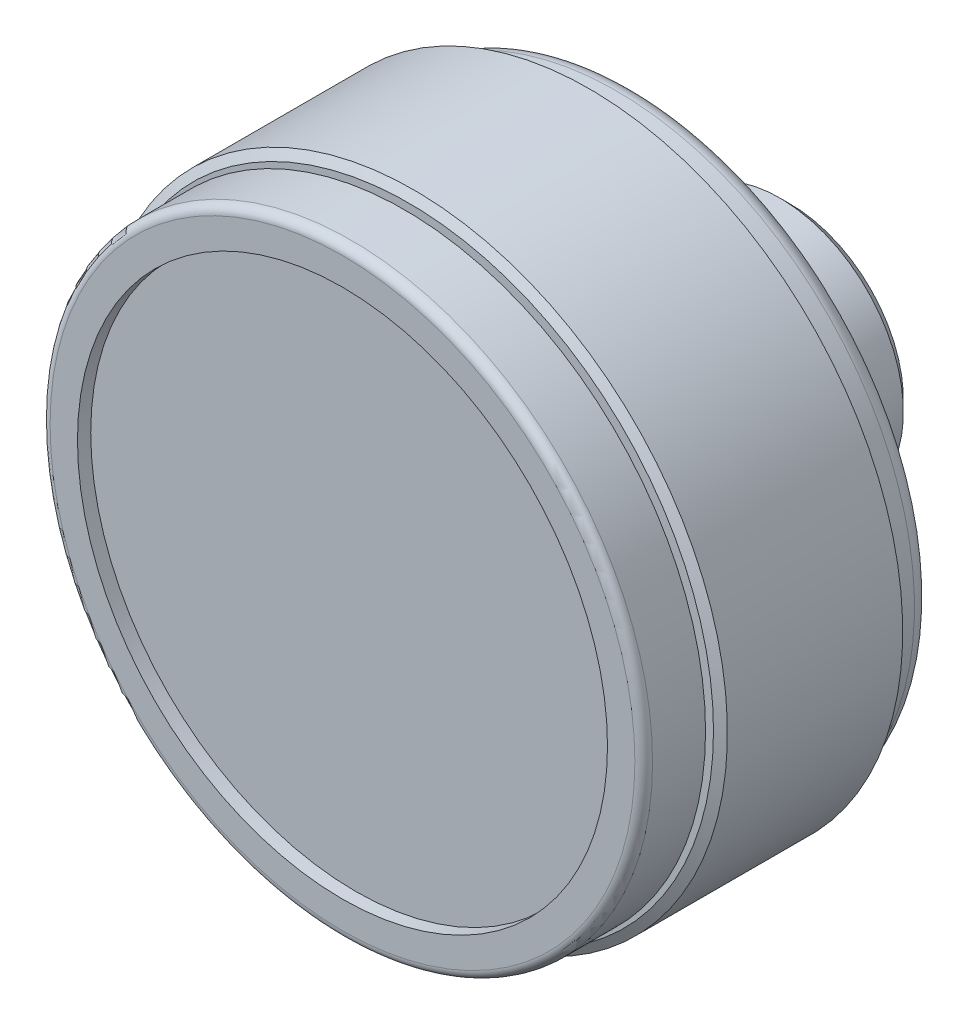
ISO-10303-21;
HEADER;
FILE_DESCRIPTION(('STEP AP214'),'2;1');
FILE_NAME('part.step','',(''),(''),'','','');
FILE_SCHEMA(('AUTOMOTIVE_DESIGN { 1 0 10303 214 1 1 1 1 }'));
ENDSEC;
DATA;
#1=APPLICATION_CONTEXT('core data for automotive mechanical design processes');
#2=APPLICATION_PROTOCOL_DEFINITION('international standard','automotive_design',2000,#1);
#3=PRODUCT_CONTEXT('',#1,'mechanical');
#4=PRODUCT('Part','Part','',(#3));
#5=PRODUCT_RELATED_PRODUCT_CATEGORY('part','',(#4));
#6=PRODUCT_DEFINITION_FORMATION('','',#4);
#7=PRODUCT_DEFINITION_CONTEXT('part definition',#1,'design');
#8=PRODUCT_DEFINITION('design','',#6,#7);
#9=PRODUCT_DEFINITION_SHAPE('','',#8);
#10=(LENGTH_UNIT() NAMED_UNIT(*) SI_UNIT(.MILLI.,.METRE.));
#11=(NAMED_UNIT(*) PLANE_ANGLE_UNIT() SI_UNIT($,.RADIAN.));
#12=(NAMED_UNIT(*) SI_UNIT($,.STERADIAN.) SOLID_ANGLE_UNIT());
#13=UNCERTAINTY_MEASURE_WITH_UNIT(LENGTH_MEASURE(1.E-05),#10,'distance_accuracy_value','');
#14=(GEOMETRIC_REPRESENTATION_CONTEXT(3) GLOBAL_UNCERTAINTY_ASSIGNED_CONTEXT((#13)) GLOBAL_UNIT_ASSIGNED_CONTEXT((#10,
#11,#12)) REPRESENTATION_CONTEXT('',''));
#15=CARTESIAN_POINT('',(0.,0.,0.));
#16=DIRECTION('',(0.,0.,1.));
#17=DIRECTION('',(1.,0.,0.));
#18=AXIS2_PLACEMENT_3D('',#15,#16,#17);
#19=CARTESIAN_POINT('',(0.,0.,50.));
#20=DIRECTION('',(0.,0.,1.));
#21=DIRECTION('',(-1.,0.,0.));
#22=AXIS2_PLACEMENT_3D('',#19,#20,#21);
#23=TOROIDAL_SURFACE('',#22,33.1,1.);
#24=CARTESIAN_POINT('',(0.,0.,50.));
#25=DIRECTION('',(0.,0.,1.));
#26=DIRECTION('',(-1.,0.,0.));
#27=AXIS2_PLACEMENT_3D('',#24,#25,#26);
#28=CIRCLE('',#27,34.1);
#29=CARTESIAN_POINT('',(-34.1,0.,50.));
#30=VERTEX_POINT('',#29);
#31=EDGE_CURVE('E8',#30,#30,#28,.T.);
#32=ORIENTED_EDGE('',*,*,#31,.T.);
#33=EDGE_LOOP('',(#32));
#34=FACE_BOUND('',#33,.T.);
#35=CARTESIAN_POINT('',(0.,0.,51.));
#36=DIRECTION('',(0.,0.,1.));
#37=DIRECTION('',(-1.,0.,0.));
#38=AXIS2_PLACEMENT_3D('',#35,#36,#37);
#39=CIRCLE('',#38,33.1);
#40=CARTESIAN_POINT('',(-33.1,0.,51.));
#41=VERTEX_POINT('',#40);
#42=EDGE_CURVE('E78',#41,#41,#39,.T.);
#43=ORIENTED_EDGE('',*,*,#42,.F.);
#44=EDGE_LOOP('',(#43));
#45=FACE_BOUND('',#44,.T.);
#46=ADVANCED_FACE('F12',(#34,#45),#23,.T.);
#47=CARTESIAN_POINT('',(0.,0.,64.9234330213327));
#48=DIRECTION('',(0.,0.,1.));
#49=DIRECTION('',(-1.,0.,0.));
#50=AXIS2_PLACEMENT_3D('',#47,#48,#49);
#51=CYLINDRICAL_SURFACE('',#50,34.1);
#52=CARTESIAN_POINT('',(0.,0.,44.));
#53=DIRECTION('',(0.,0.,1.));
#54=DIRECTION('',(-1.,0.,0.));
#55=AXIS2_PLACEMENT_3D('',#52,#53,#54);
#56=CIRCLE('',#55,34.1);
#57=CARTESIAN_POINT('',(-34.1,0.,44.));
#58=VERTEX_POINT('',#57);
#59=EDGE_CURVE('E24',#58,#58,#56,.T.);
#60=ORIENTED_EDGE('',*,*,#59,.T.);
#61=EDGE_LOOP('',(#60));
#62=FACE_BOUND('',#61,.T.);
#63=ORIENTED_EDGE('',*,*,#31,.F.);
#64=EDGE_LOOP('',(#63));
#65=FACE_BOUND('',#64,.T.);
#66=ADVANCED_FACE('F147',(#62,#65),#51,.T.);
#67=CARTESIAN_POINT('',(0.,34.1,44.));
#68=DIRECTION('',(0.,0.,-1.));
#69=DIRECTION('',(1.,0.,0.));
#70=AXIS2_PLACEMENT_3D('',#67,#68,#69);
#71=PLANE('',#70);
#72=CARTESIAN_POINT('',(0.,0.,44.));
#73=DIRECTION('',(0.,0.,1.));
#74=DIRECTION('',(-1.,0.,0.));
#75=AXIS2_PLACEMENT_3D('',#72,#73,#74);
#76=CIRCLE('',#75,32.6);
#77=CARTESIAN_POINT('',(-32.6,0.,44.));
#78=VERTEX_POINT('',#77);
#79=EDGE_CURVE('E28',#78,#78,#76,.T.);
#80=ORIENTED_EDGE('',*,*,#79,.T.);
#81=EDGE_LOOP('',(#80));
#82=FACE_BOUND('',#81,.T.);
#83=ORIENTED_EDGE('',*,*,#59,.F.);
#84=EDGE_LOOP('',(#83));
#85=FACE_BOUND('',#84,.T.);
#86=ADVANCED_FACE('F152',(#82,#85),#71,.T.);
#87=CARTESIAN_POINT('',(0.,0.,64.9234330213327));
#88=DIRECTION('',(0.,0.,1.));
#89=DIRECTION('',(-1.,0.,0.));
#90=AXIS2_PLACEMENT_3D('',#87,#88,#89);
#91=CYLINDRICAL_SURFACE('',#90,32.6);
#92=CARTESIAN_POINT('',(0.,0.,43.5));
#93=DIRECTION('',(0.,0.,1.));
#94=DIRECTION('',(-1.,0.,0.));
#95=AXIS2_PLACEMENT_3D('',#92,#93,#94);
#96=CIRCLE('',#95,32.6);
#97=CARTESIAN_POINT('',(-32.6,0.,43.5));
#98=VERTEX_POINT('',#97);
#99=EDGE_CURVE('E33',#98,#98,#96,.T.);
#100=ORIENTED_EDGE('',*,*,#99,.T.);
#101=EDGE_LOOP('',(#100));
#102=FACE_BOUND('',#101,.T.);
#103=ORIENTED_EDGE('',*,*,#79,.F.);
#104=EDGE_LOOP('',(#103));
#105=FACE_BOUND('',#104,.T.);
#106=ADVANCED_FACE('F161',(#102,#105),#91,.T.);
#107=CARTESIAN_POINT('',(0.,34.5,43.5));
#108=DIRECTION('',(0.,0.,-1.));
#109=DIRECTION('',(1.,0.,0.));
#110=AXIS2_PLACEMENT_3D('',#107,#108,#109);
#111=PLANE('',#110);
#112=ORIENTED_EDGE('',*,*,#99,.F.);
#113=EDGE_LOOP('',(#112));
#114=FACE_BOUND('',#113,.T.);
#115=CARTESIAN_POINT('',(0.,0.,43.5));
#116=DIRECTION('',(0.,0.,1.));
#117=DIRECTION('',(-1.,0.,0.));
#118=AXIS2_PLACEMENT_3D('',#115,#116,#117);
#119=CIRCLE('',#118,34.5);
#120=CARTESIAN_POINT('',(-34.5,0.,43.5));
#121=VERTEX_POINT('',#120);
#122=EDGE_CURVE('E36',#121,#121,#119,.T.);
#123=ORIENTED_EDGE('',*,*,#122,.T.);
#124=EDGE_LOOP('',(#123));
#125=FACE_BOUND('',#124,.T.);
#126=ADVANCED_FACE('F168',(#114,#125),#111,.F.);
#127=CARTESIAN_POINT('',(0.,0.,43.5));
#128=DIRECTION('',(0.,0.,-1.));
#129=DIRECTION('',(1.,0.,0.));
#130=AXIS2_PLACEMENT_3D('',#127,#128,#129);
#131=CONICAL_SURFACE('',#130,34.5,1.04719775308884);
#132=CARTESIAN_POINT('',(0.,0.,42.92265));
#133=DIRECTION('',(0.,0.,1.));
#134=DIRECTION('',(-1.,0.,0.));
#135=AXIS2_PLACEMENT_3D('',#132,#133,#134);
#136=CIRCLE('',#135,35.5);
#137=CARTESIAN_POINT('',(-35.5,0.,42.92265));
#138=VERTEX_POINT('',#137);
#139=EDGE_CURVE('E39',#138,#138,#136,.T.);
#140=ORIENTED_EDGE('',*,*,#139,.T.);
#141=EDGE_LOOP('',(#140));
#142=FACE_BOUND('',#141,.T.);
#143=ORIENTED_EDGE('',*,*,#122,.F.);
#144=EDGE_LOOP('',(#143));
#145=FACE_BOUND('',#144,.T.);
#146=ADVANCED_FACE('F172',(#142,#145),#131,.T.);
#147=CARTESIAN_POINT('',(0.,0.,64.9234330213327));
#148=DIRECTION('',(0.,0.,1.));
#149=DIRECTION('',(-1.,0.,0.));
#150=AXIS2_PLACEMENT_3D('',#147,#148,#149);
#151=CYLINDRICAL_SURFACE('',#150,35.5);
#152=CARTESIAN_POINT('',(0.,0.,23.07735));
#153=DIRECTION('',(0.,0.,1.));
#154=DIRECTION('',(-1.,0.,0.));
#155=AXIS2_PLACEMENT_3D('',#152,#153,#154);
#156=CIRCLE('',#155,35.5);
#157=CARTESIAN_POINT('',(-35.5,0.,23.07735));
#158=VERTEX_POINT('',#157);
#159=EDGE_CURVE('E42',#158,#158,#156,.T.);
#160=ORIENTED_EDGE('',*,*,#159,.T.);
#161=EDGE_LOOP('',(#160));
#162=FACE_BOUND('',#161,.T.);
#163=ORIENTED_EDGE('',*,*,#139,.F.);
#164=EDGE_LOOP('',(#163));
#165=FACE_BOUND('',#164,.T.);
#166=ADVANCED_FACE('F176',(#162,#165),#151,.T.);
#167=CARTESIAN_POINT('',(0.,0.,23.07735));
#168=DIRECTION('',(0.,0.,1.));
#169=DIRECTION('',(-1.,0.,0.));
#170=AXIS2_PLACEMENT_3D('',#167,#168,#169);
#171=CONICAL_SURFACE('',#170,35.5,1.04719775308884);
#172=CARTESIAN_POINT('',(0.,0.,22.5));
#173=DIRECTION('',(0.,0.,1.));
#174=DIRECTION('',(-1.,0.,0.));
#175=AXIS2_PLACEMENT_3D('',#172,#173,#174);
#176=CIRCLE('',#175,34.5);
#177=CARTESIAN_POINT('',(-34.5,0.,22.5));
#178=VERTEX_POINT('',#177);
#179=EDGE_CURVE('E45',#178,#178,#176,.T.);
#180=ORIENTED_EDGE('',*,*,#179,.T.);
#181=EDGE_LOOP('',(#180));
#182=FACE_BOUND('',#181,.T.);
#183=ORIENTED_EDGE('',*,*,#159,.F.);
#184=EDGE_LOOP('',(#183));
#185=FACE_BOUND('',#184,.T.);
#186=ADVANCED_FACE('F180',(#182,#185),#171,.T.);
#187=CARTESIAN_POINT('',(0.,33.75,22.5));
#188=DIRECTION('',(0.,0.,1.));
#189=DIRECTION('',(-1.,0.,0.));
#190=AXIS2_PLACEMENT_3D('',#187,#188,#189);
#191=PLANE('',#190);
#192=ORIENTED_EDGE('',*,*,#179,.F.);
#193=EDGE_LOOP('',(#192));
#194=FACE_BOUND('',#193,.T.);
#195=CARTESIAN_POINT('',(0.,0.,22.5));
#196=DIRECTION('',(0.,0.,1.));
#197=DIRECTION('',(-1.,0.,0.));
#198=AXIS2_PLACEMENT_3D('',#195,#196,#197);
#199=CIRCLE('',#198,33.75);
#200=CARTESIAN_POINT('',(-33.75,0.,22.5));
#201=VERTEX_POINT('',#200);
#202=EDGE_CURVE('E48',#201,#201,#199,.T.);
#203=ORIENTED_EDGE('',*,*,#202,.T.);
#204=EDGE_LOOP('',(#203));
#205=FACE_BOUND('',#204,.T.);
#206=ADVANCED_FACE('F184',(#194,#205),#191,.F.);
#207=CARTESIAN_POINT('',(0.,0.,64.9234330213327));
#208=DIRECTION('',(0.,0.,1.));
#209=DIRECTION('',(-1.,0.,0.));
#210=AXIS2_PLACEMENT_3D('',#207,#208,#209);
#211=CYLINDRICAL_SURFACE('',#210,33.75);
#212=CARTESIAN_POINT('',(0.,0.,20.));
#213=DIRECTION('',(0.,0.,1.));
#214=DIRECTION('',(-1.,0.,0.));
#215=AXIS2_PLACEMENT_3D('',#212,#213,#214);
#216=CIRCLE('',#215,33.75);
#217=CARTESIAN_POINT('',(-33.75,0.,20.));
#218=VERTEX_POINT('',#217);
#219=EDGE_CURVE('E51',#218,#218,#216,.T.);
#220=ORIENTED_EDGE('',*,*,#219,.T.);
#221=EDGE_LOOP('',(#220));
#222=FACE_BOUND('',#221,.T.);
#223=ORIENTED_EDGE('',*,*,#202,.F.);
#224=EDGE_LOOP('',(#223));
#225=FACE_BOUND('',#224,.T.);
#226=ADVANCED_FACE('F188',(#222,#225),#211,.T.);
#227=CARTESIAN_POINT('',(0.,0.,20.));
#228=DIRECTION('',(0.,0.,1.));
#229=DIRECTION('',(-1.,0.,0.));
#230=AXIS2_PLACEMENT_3D('',#227,#228,#229);
#231=TOROIDAL_SURFACE('',#230,31.75,2.);
#232=CARTESIAN_POINT('',(0.,0.,18.));
#233=DIRECTION('',(0.,0.,1.));
#234=DIRECTION('',(-1.,0.,0.));
#235=AXIS2_PLACEMENT_3D('',#232,#233,#234);
#236=CIRCLE('',#235,31.75);
#237=CARTESIAN_POINT('',(-31.75,0.,18.));
#238=VERTEX_POINT('',#237);
#239=EDGE_CURVE('E54',#238,#238,#236,.T.);
#240=ORIENTED_EDGE('',*,*,#239,.T.);
#241=EDGE_LOOP('',(#240));
#242=FACE_BOUND('',#241,.T.);
#243=ORIENTED_EDGE('',*,*,#219,.F.);
#244=EDGE_LOOP('',(#243));
#245=FACE_BOUND('',#244,.T.);
#246=ADVANCED_FACE('F192',(#242,#245),#231,.T.);
#247=CARTESIAN_POINT('',(0.,16.,18.));
#248=DIRECTION('',(0.,0.,1.));
#249=DIRECTION('',(-1.,0.,0.));
#250=AXIS2_PLACEMENT_3D('',#247,#248,#249);
#251=PLANE('',#250);
#252=ORIENTED_EDGE('',*,*,#239,.F.);
#253=EDGE_LOOP('',(#252));
#254=FACE_BOUND('',#253,.T.);
#255=CARTESIAN_POINT('',(0.,0.,18.));
#256=DIRECTION('',(0.,0.,1.));
#257=DIRECTION('',(-1.,0.,0.));
#258=AXIS2_PLACEMENT_3D('',#255,#256,#257);
#259=CIRCLE('',#258,16.);
#260=CARTESIAN_POINT('',(-16.,0.,18.));
#261=VERTEX_POINT('',#260);
#262=EDGE_CURVE('E57',#261,#261,#259,.T.);
#263=ORIENTED_EDGE('',*,*,#262,.T.);
#264=EDGE_LOOP('',(#263));
#265=FACE_BOUND('',#264,.T.);
#266=ADVANCED_FACE('F196',(#254,#265),#251,.F.);
#267=CARTESIAN_POINT('',(0.,0.,16.0010004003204));
#268=DIRECTION('',(0.,0.,1.));
#269=DIRECTION('',(-1.,0.,0.));
#270=AXIS2_PLACEMENT_3D('',#267,#268,#269);
#271=TOROIDAL_SURFACE('',#270,15.9367496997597,2.);
#272=ORIENTED_EDGE('',*,*,#262,.F.);
#273=EDGE_LOOP('',(#272));
#274=FACE_BOUND('',#273,.T.);
#275=CARTESIAN_POINT('',(0.,0.,16.5));
#276=DIRECTION('',(0.,0.,1.));
#277=DIRECTION('',(-1.,0.,0.));
#278=AXIS2_PLACEMENT_3D('',#275,#276,#277);
#279=CIRCLE('',#278,14.);
#280=CARTESIAN_POINT('',(-14.,0.,16.5));
#281=VERTEX_POINT('',#280);
#282=EDGE_CURVE('E60',#281,#281,#279,.T.);
#283=ORIENTED_EDGE('',*,*,#282,.T.);
#284=EDGE_LOOP('',(#283));
#285=FACE_BOUND('',#284,.T.);
#286=ADVANCED_FACE('F142',(#274,#285),#271,.F.);
#287=CARTESIAN_POINT('',(0.,0.,64.9234330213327));
#288=DIRECTION('',(0.,0.,1.));
#289=DIRECTION('',(-1.,0.,0.));
#290=AXIS2_PLACEMENT_3D('',#287,#288,#289);
#291=CYLINDRICAL_SURFACE('',#290,14.);
#292=CARTESIAN_POINT('',(13.9961059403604,-0.330179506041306,3.5));
#293=CARTESIAN_POINT('',(13.999380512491,-0.191270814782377,3.50000531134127));
#294=CARTESIAN_POINT('',(14.0005722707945,-0.0522430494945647,3.51161611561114));
#295=CARTESIAN_POINT('',(13.9989131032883,0.222004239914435,3.55777535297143));
#296=CARTESIAN_POINT('',(13.9960588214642,0.357220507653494,3.5923428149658));
#297=CARTESIAN_POINT('',(13.9868889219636,0.619834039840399,3.68337132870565));
#298=CARTESIAN_POINT('',(13.9805758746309,0.747237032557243,3.73981611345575));
#299=CARTESIAN_POINT('',(13.9654305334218,0.990786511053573,3.8729568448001));
#300=CARTESIAN_POINT('',(13.956598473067,1.10693403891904,3.94965091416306));
#301=CARTESIAN_POINT('',(13.9375245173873,1.32574014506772,4.12184467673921));
#302=CARTESIAN_POINT('',(13.9272717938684,1.42828198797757,4.21749149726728));
#303=CARTESIAN_POINT('',(13.9067453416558,1.61597327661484,4.42455777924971));
#304=CARTESIAN_POINT('',(13.8964716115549,1.70112151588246,4.53597833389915));
#305=CARTESIAN_POINT('',(13.877135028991,1.85229584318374,4.77253694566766));
#306=CARTESIAN_POINT('',(13.8680829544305,1.91815705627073,4.89778135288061));
#307=CARTESIAN_POINT('',(13.8524653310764,2.02787928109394,5.15770794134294));
#308=CARTESIAN_POINT('',(13.8458996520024,2.07174144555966,5.29238962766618));
#309=CARTESIAN_POINT('',(13.8361443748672,2.13592279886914,5.56640464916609));
#310=CARTESIAN_POINT('',(13.8329321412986,2.15639992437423,5.70570016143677));
#311=CARTESIAN_POINT('',(13.830222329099,2.17371379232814,5.98578412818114));
#312=CARTESIAN_POINT('',(13.83072451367,2.17055204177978,6.12657248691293));
#313=CARTESIAN_POINT('',(13.8353552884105,2.14083156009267,6.40425428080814));
#314=CARTESIAN_POINT('',(13.8394498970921,2.11449206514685,6.54117183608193));
#315=CARTESIAN_POINT('',(13.8506978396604,2.03950821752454,6.80862243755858));
#316=CARTESIAN_POINT('',(13.8578512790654,1.99086309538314,6.93915526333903));
#317=CARTESIAN_POINT('',(13.8743502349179,1.87242554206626,7.19077720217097));
#318=CARTESIAN_POINT('',(13.8837050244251,1.80254327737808,7.31182339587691));
#319=CARTESIAN_POINT('',(13.9034077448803,1.64366680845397,7.5405598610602));
#320=CARTESIAN_POINT('',(13.9137557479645,1.55467121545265,7.64824916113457));
#321=CARTESIAN_POINT('',(13.9342381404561,1.35895830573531,7.84840754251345));
#322=CARTESIAN_POINT('',(13.9443691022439,1.25206311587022,7.9407031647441));
#323=CARTESIAN_POINT('',(13.9629546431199,1.0241797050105,8.10606958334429));
#324=CARTESIAN_POINT('',(13.9714092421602,0.903191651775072,8.17914060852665));
#325=CARTESIAN_POINT('',(13.9854398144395,0.650703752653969,8.30383579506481));
#326=CARTESIAN_POINT('',(13.9910203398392,0.519220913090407,8.35549384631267));
#327=CARTESIAN_POINT('',(13.9984295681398,0.249345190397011,8.43597492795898));
#328=CARTESIAN_POINT('',(14.0002586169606,0.110952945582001,8.46480006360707));
#329=CARTESIAN_POINT('',(13.9996854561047,-0.166943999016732,8.49853978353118));
#330=CARTESIAN_POINT('',(13.9973359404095,-0.306413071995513,8.50374923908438));
#331=CARTESIAN_POINT('',(13.9884981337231,-0.584143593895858,8.49094885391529));
#332=CARTESIAN_POINT('',(13.9820099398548,-0.722405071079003,8.47293955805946));
#333=CARTESIAN_POINT('',(13.9653731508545,-0.993339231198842,8.41440758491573));
#334=CARTESIAN_POINT('',(13.9552371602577,-1.12602942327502,8.37396217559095));
#335=CARTESIAN_POINT('',(13.9321476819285,-1.38270863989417,8.27184183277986));
#336=CARTESIAN_POINT('',(13.9191939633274,-1.5066969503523,8.210165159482));
#337=CARTESIAN_POINT('',(13.891442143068,-1.74422941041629,8.06639468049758));
#338=CARTESIAN_POINT('',(13.8766221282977,-1.85761569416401,7.98404431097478));
#339=CARTESIAN_POINT('',(13.8466757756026,-2.06905634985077,7.80161272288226));
#340=CARTESIAN_POINT('',(13.8315494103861,-2.16710934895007,7.70152991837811));
#341=CARTESIAN_POINT('',(13.8022944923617,-2.34627882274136,7.48503075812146));
#342=CARTESIAN_POINT('',(13.7881798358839,-2.42718156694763,7.36843543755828));
#343=CARTESIAN_POINT('',(13.7626086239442,-2.56822184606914,7.12302799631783));
#344=CARTESIAN_POINT('',(13.7511519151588,-2.62836057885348,6.99421658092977));
#345=CARTESIAN_POINT('',(13.7322027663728,-2.72563002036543,6.72910112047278));
#346=CARTESIAN_POINT('',(13.7246786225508,-2.76294515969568,6.59286709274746));
#347=CARTESIAN_POINT('',(13.7142749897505,-2.8141351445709,6.31589675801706));
#348=CARTESIAN_POINT('',(13.7113949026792,-2.82801300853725,6.17516103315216));
#349=CARTESIAN_POINT('',(13.7106044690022,-2.83184128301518,5.89592641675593));
#350=CARTESIAN_POINT('',(13.7126045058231,-2.82222316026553,5.75743350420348));
#351=CARTESIAN_POINT('',(13.7211713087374,-2.78027133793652,5.48408324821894));
#352=CARTESIAN_POINT('',(13.7277380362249,-2.74793783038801,5.34922587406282));
#353=CARTESIAN_POINT('',(13.7447279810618,-2.66164727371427,5.08717200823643));
#354=CARTESIAN_POINT('',(13.7551438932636,-2.60773116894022,4.95996153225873));
#355=CARTESIAN_POINT('',(13.778769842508,-2.47986103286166,4.71633317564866));
#356=CARTESIAN_POINT('',(13.7919800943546,-2.40590546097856,4.59991612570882));
#357=CARTESIAN_POINT('',(13.8201316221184,-2.23858460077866,4.37904014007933));
#358=CARTESIAN_POINT('',(13.8350985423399,-2.14491026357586,4.27481856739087));
#359=CARTESIAN_POINT('',(13.8651078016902,-1.9414779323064,4.083434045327));
#360=CARTESIAN_POINT('',(13.8801501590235,-1.83171585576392,3.99627543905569));
#361=CARTESIAN_POINT('',(13.9090464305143,-1.59765064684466,3.84048057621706));
#362=CARTESIAN_POINT('',(13.922883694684,-1.47318712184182,3.77208209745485));
#363=CARTESIAN_POINT('',(13.9478401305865,-1.21433098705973,3.6572914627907));
#364=CARTESIAN_POINT('',(13.9589618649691,-1.07994789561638,3.61087851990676));
#365=CARTESIAN_POINT('',(13.9749767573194,-0.842668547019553,3.55092063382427));
#366=CARTESIAN_POINT('',(13.9807414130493,-0.741188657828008,3.53186240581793));
#367=CARTESIAN_POINT('',(13.9900893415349,-0.536554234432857,3.50640028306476));
#368=CARTESIAN_POINT('',(13.9936726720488,-0.433399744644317,3.49999605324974));
#369=CARTESIAN_POINT('',(13.9961059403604,-0.330179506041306,3.5));
#370=B_SPLINE_CURVE_WITH_KNOTS('',3,(#292,#293,#294,#295,#296,#297,#298,#299,#300,#301,#302,
#303,#304,#305,#306,#307,#308,#309,#310,#311,#312,#313,#314,#315,#316,#317,#318,#319,#320,#321,
#322,#323,#324,#325,#326,#327,#328,#329,#330,#331,#332,#333,#334,#335,#336,#337,#338,#339,#340,
#341,#342,#343,#344,#345,#346,#347,#348,#349,#350,#351,#352,#353,#354,#355,#356,#357,#358,#359,
#360,#361,#362,#363,#364,#365,#366,#367,#368,#369),.UNSPECIFIED.,.T.,.F.,(4,2,2,2,2,2,2,2,2,2,2,
2,2,2,2,2,2,2,2,2,2,2,2,2,2,2,2,2,2,2,2,2,2,2,2,2,2,2,4),(0.,0.416466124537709,
0.833277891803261,1.24978032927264,1.66624416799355,2.08607741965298,2.50593978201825,
2.9292930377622,3.35262410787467,3.773078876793,4.19350684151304,4.61000025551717,
5.02650803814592,5.44480277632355,5.86312791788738,6.28588789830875,6.70864284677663,
7.13072613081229,7.5527704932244,7.96953032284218,8.3862803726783,8.80160400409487,
9.21696167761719,9.63775355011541,10.0585830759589,10.4843833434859,10.9101590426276,
11.3324470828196,11.7546807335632,12.1692192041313,12.583754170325,12.9975064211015,
13.4112904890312,13.8321200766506,14.2530566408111,14.6791048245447,15.1047493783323,
15.4142251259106,15.7236926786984),.UNSPECIFIED.);
#371=CARTESIAN_POINT('',(13.9961059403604,-0.330179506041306,3.5));
#372=VERTEX_POINT('',#371);
#373=EDGE_CURVE('E87',#372,#372,#370,.T.);
#374=ORIENTED_EDGE('',*,*,#373,.F.);
#375=EDGE_LOOP('',(#374));
#376=FACE_BOUND('',#375,.T.);
#377=CARTESIAN_POINT('',(0.,0.,1.5));
#378=DIRECTION('',(0.,0.,1.));
#379=DIRECTION('',(-1.,0.,0.));
#380=AXIS2_PLACEMENT_3D('',#377,#378,#379);
#381=CIRCLE('',#380,14.);
#382=CARTESIAN_POINT('',(-14.,0.,1.5));
#383=VERTEX_POINT('',#382);
#384=EDGE_CURVE('E63',#383,#383,#381,.T.);
#385=ORIENTED_EDGE('',*,*,#384,.T.);
#386=EDGE_LOOP('',(#385));
#387=FACE_BOUND('',#386,.T.);
#388=ORIENTED_EDGE('',*,*,#282,.F.);
#389=EDGE_LOOP('',(#388));
#390=FACE_BOUND('',#389,.T.);
#391=ADVANCED_FACE('F95',(#376,#387,#390),#291,.T.);
#392=CARTESIAN_POINT('',(0.,0.,0.299999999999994));
#393=DIRECTION('',(0.,0.,1.));
#394=DIRECTION('',(-1.,0.,0.));
#395=AXIS2_PLACEMENT_3D('',#392,#393,#394);
#396=CONICAL_SURFACE('',#395,12.8,0.785398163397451);
#397=ORIENTED_EDGE('',*,*,#384,.F.);
#398=EDGE_LOOP('',(#397));
#399=FACE_BOUND('',#398,.T.);
#400=CARTESIAN_POINT('',(0.,0.,0.299999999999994));
#401=DIRECTION('',(0.,0.,1.));
#402=DIRECTION('',(-1.,0.,0.));
#403=AXIS2_PLACEMENT_3D('',#400,#401,#402);
#404=CIRCLE('',#403,12.8);
#405=CARTESIAN_POINT('',(-12.8,0.,0.299999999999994));
#406=VERTEX_POINT('',#405);
#407=EDGE_CURVE('E66',#406,#406,#404,.T.);
#408=ORIENTED_EDGE('',*,*,#407,.T.);
#409=EDGE_LOOP('',(#408));
#410=FACE_BOUND('',#409,.T.);
#411=ADVANCED_FACE('F133',(#399,#410),#396,.T.);
#412=CARTESIAN_POINT('',(0.,11.4166817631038,0.299999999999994));
#413=DIRECTION('',(0.,0.,1.));
#414=DIRECTION('',(-1.,0.,0.));
#415=AXIS2_PLACEMENT_3D('',#412,#413,#414);
#416=PLANE('',#415);
#417=ORIENTED_EDGE('',*,*,#407,.F.);
#418=EDGE_LOOP('',(#417));
#419=FACE_BOUND('',#418,.T.);
#420=CARTESIAN_POINT('',(0.,0.,0.299999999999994));
#421=DIRECTION('',(0.,0.,1.));
#422=DIRECTION('',(-1.,0.,0.));
#423=AXIS2_PLACEMENT_3D('',#420,#421,#422);
#424=CIRCLE('',#423,11.4166817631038);
#425=CARTESIAN_POINT('',(-11.4166817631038,0.,0.299999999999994));
#426=VERTEX_POINT('',#425);
#427=EDGE_CURVE('E69',#426,#426,#424,.T.);
#428=ORIENTED_EDGE('',*,*,#427,.T.);
#429=EDGE_LOOP('',(#428));
#430=FACE_BOUND('',#429,.T.);
#431=ADVANCED_FACE('F130',(#419,#430),#416,.F.);
#432=CARTESIAN_POINT('',(0.,0.,0.));
#433=DIRECTION('',(0.,0.,1.));
#434=DIRECTION('',(-1.,0.,0.));
#435=AXIS2_PLACEMENT_3D('',#432,#433,#434);
#436=CONICAL_SURFACE('',#435,11.,0.946790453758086);
#437=ORIENTED_EDGE('',*,*,#427,.F.);
#438=EDGE_LOOP('',(#437));
#439=FACE_BOUND('',#438,.T.);
#440=CARTESIAN_POINT('',(0.,0.,0.));
#441=DIRECTION('',(0.,0.,1.));
#442=DIRECTION('',(-1.,0.,0.));
#443=AXIS2_PLACEMENT_3D('',#440,#441,#442);
#444=CIRCLE('',#443,11.);
#445=CARTESIAN_POINT('',(-11.,0.,0.));
#446=VERTEX_POINT('',#445);
#447=EDGE_CURVE('E72',#446,#446,#444,.T.);
#448=ORIENTED_EDGE('',*,*,#447,.T.);
#449=EDGE_LOOP('',(#448));
#450=FACE_BOUND('',#449,.T.);
#451=ADVANCED_FACE('F126',(#439,#450),#436,.T.);
#452=CARTESIAN_POINT('',(0.,5.,0.));
#453=DIRECTION('',(0.,0.,1.));
#454=DIRECTION('',(-1.,0.,0.));
#455=AXIS2_PLACEMENT_3D('',#452,#453,#454);
#456=PLANE('',#455);
#457=ORIENTED_EDGE('',*,*,#447,.F.);
#458=EDGE_LOOP('',(#457));
#459=FACE_BOUND('',#458,.T.);
#460=CARTESIAN_POINT('',(0.,0.,0.));
#461=DIRECTION('',(0.,0.,1.));
#462=DIRECTION('',(-1.,0.,0.));
#463=AXIS2_PLACEMENT_3D('',#460,#461,#462);
#464=CIRCLE('',#463,5.);
#465=CARTESIAN_POINT('',(-5.,0.,0.));
#466=VERTEX_POINT('',#465);
#467=EDGE_CURVE('E75',#466,#466,#464,.T.);
#468=ORIENTED_EDGE('',*,*,#467,.T.);
#469=EDGE_LOOP('',(#468));
#470=FACE_BOUND('',#469,.T.);
#471=ADVANCED_FACE('F122',(#459,#470),#456,.F.);
#472=CARTESIAN_POINT('',(0.,0.,64.9234330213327));
#473=DIRECTION('',(0.,0.,1.));
#474=DIRECTION('',(-1.,0.,0.));
#475=AXIS2_PLACEMENT_3D('',#472,#473,#474);
#476=CYLINDRICAL_SURFACE('',#475,5.);
#477=CARTESIAN_POINT('',(4.98908623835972,-0.330179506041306,3.5));
#478=CARTESIAN_POINT('',(4.99763794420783,-0.200839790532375,3.5000095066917));
#479=CARTESIAN_POINT('',(5.00113322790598,-0.0710217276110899,3.51009434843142));
#480=CARTESIAN_POINT('',(4.99821184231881,0.185469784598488,3.55030302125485));
#481=CARTESIAN_POINT('',(4.99177987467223,0.312138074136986,3.58045774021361));
#482=CARTESIAN_POINT('',(4.97027248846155,0.558214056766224,3.65961331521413));
#483=CARTESIAN_POINT('',(4.95522299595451,0.6776423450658,3.70855749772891));
#484=CARTESIAN_POINT('',(4.91846922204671,0.906719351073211,3.8236433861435));
#485=CARTESIAN_POINT('',(4.89676494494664,1.0163680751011,3.8897850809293));
#486=CARTESIAN_POINT('',(4.84800509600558,1.22851088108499,4.04086273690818));
#487=CARTESIAN_POINT('',(4.82074836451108,1.33043905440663,4.12652678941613));
#488=CARTESIAN_POINT('',(4.76461110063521,1.5192774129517,4.31266288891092));
#489=CARTESIAN_POINT('',(4.735729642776,1.60617892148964,4.41314342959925));
#490=CARTESIAN_POINT('',(4.67737501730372,1.76924742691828,4.63515543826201));
#491=CARTESIAN_POINT('',(4.64802770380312,1.84407151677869,4.75771233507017));
#492=CARTESIAN_POINT('',(4.59521215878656,1.97201506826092,5.01485981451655));
#493=CARTESIAN_POINT('',(4.57174196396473,2.0251417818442,5.14944635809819));
#494=CARTESIAN_POINT('',(4.53489334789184,2.10634628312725,5.4228907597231));
#495=CARTESIAN_POINT('',(4.52123349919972,2.13512721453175,5.56149963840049));
#496=CARTESIAN_POINT('',(4.5051706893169,2.16882763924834,5.84218845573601));
#497=CARTESIAN_POINT('',(4.50275925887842,2.17376508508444,5.98426570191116));
#498=CARTESIAN_POINT('',(4.50927156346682,2.16020618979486,6.25410943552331));
#499=CARTESIAN_POINT('',(4.51719310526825,2.14378212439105,6.38201144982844));
#500=CARTESIAN_POINT('',(4.54151966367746,2.09174888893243,6.63300621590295));
#501=CARTESIAN_POINT('',(4.55792664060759,2.05613528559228,6.75609784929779));
#502=CARTESIAN_POINT('',(4.59732975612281,1.96646091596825,6.99602469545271));
#503=CARTESIAN_POINT('',(4.62040741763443,1.91217023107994,7.11275985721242));
#504=CARTESIAN_POINT('',(4.67032011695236,1.78680014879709,7.3359637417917));
#505=CARTESIAN_POINT('',(4.69715673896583,1.71571366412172,7.44242810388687));
#506=CARTESIAN_POINT('',(4.75426424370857,1.55089005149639,7.65258492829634));
#507=CARTESIAN_POINT('',(4.78462129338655,1.45565464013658,7.75508285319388));
#508=CARTESIAN_POINT('',(4.84268598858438,1.24896261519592,7.9431511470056));
#509=CARTESIAN_POINT('',(4.87039297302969,1.13750197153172,8.02871729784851));
#510=CARTESIAN_POINT('',(4.92017858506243,0.898355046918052,8.18203403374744));
#511=CARTESIAN_POINT('',(4.94213010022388,0.770382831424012,8.24938316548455));
#512=CARTESIAN_POINT('',(4.97638065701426,0.503644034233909,8.36127311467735));
#513=CARTESIAN_POINT('',(4.98868710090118,0.364885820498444,8.40583141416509));
#514=CARTESIAN_POINT('',(5.00084242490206,0.0927498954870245,8.46758890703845));
#515=CARTESIAN_POINT('',(5.00162193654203,-0.0401494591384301,8.48671628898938));
#516=CARTESIAN_POINT('',(4.99235404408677,-0.306901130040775,8.50345784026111));
#517=CARTESIAN_POINT('',(4.98230980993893,-0.440753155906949,8.5010783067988));
#518=CARTESIAN_POINT('',(4.95266442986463,-0.697815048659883,8.47600594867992));
#519=CARTESIAN_POINT('',(4.93362292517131,-0.821203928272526,8.45444455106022));
#520=CARTESIAN_POINT('',(4.88746035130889,-1.06196448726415,8.3937238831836));
#521=CARTESIAN_POINT('',(4.86033781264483,-1.17933506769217,8.35456141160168));
#522=CARTESIAN_POINT('',(4.79822312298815,-1.41146356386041,8.25775289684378));
#523=CARTESIAN_POINT('',(4.76289818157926,-1.52577724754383,8.1992604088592));
#524=CARTESIAN_POINT('',(4.68773095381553,-1.74310772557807,8.06636877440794));
#525=CARTESIAN_POINT('',(4.64788648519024,-1.84611901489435,7.99196192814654));
#526=CARTESIAN_POINT('',(4.56181265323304,-2.05023558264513,7.81966968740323));
#527=CARTESIAN_POINT('',(4.51536961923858,-2.14981931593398,7.72008376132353));
#528=CARTESIAN_POINT('',(4.42437550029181,-2.33135879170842,7.50502731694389));
#529=CARTESIAN_POINT('',(4.37982623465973,-2.41329787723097,7.38954195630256));
#530=CARTESIAN_POINT('',(4.29548473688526,-2.56053299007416,7.13909384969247));
#531=CARTESIAN_POINT('',(4.25599040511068,-2.62493164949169,7.00349517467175));
#532=CARTESIAN_POINT('',(4.19009206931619,-2.7289165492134,6.72021004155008));
#533=CARTESIAN_POINT('',(4.16366104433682,-2.76855405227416,6.57254927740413));
#534=CARTESIAN_POINT('',(4.13117469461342,-2.81675847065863,6.29073296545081));
#535=CARTESIAN_POINT('',(4.12285528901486,-2.82878993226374,6.15743553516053));
#536=CARTESIAN_POINT('',(4.12110877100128,-2.83133873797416,5.89055813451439));
#537=CARTESIAN_POINT('',(4.12767456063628,-2.82186633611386,5.75697832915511));
#538=CARTESIAN_POINT('',(4.15287355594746,-2.78460711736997,5.51075897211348));
#539=CARTESIAN_POINT('',(4.16991505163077,-2.75922847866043,5.39757178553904));
#540=CARTESIAN_POINT('',(4.21252912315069,-2.693718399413,5.17726101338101));
#541=CARTESIAN_POINT('',(4.23810463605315,-2.65358187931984,5.07013953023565));
#542=CARTESIAN_POINT('',(4.29784993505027,-2.55578470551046,4.85461803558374));
#543=CARTESIAN_POINT('',(4.33257818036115,-2.49689218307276,4.74693600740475));
#544=CARTESIAN_POINT('',(4.40605463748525,-2.36482525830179,4.54223619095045));
#545=CARTESIAN_POINT('',(4.44480514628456,-2.29164267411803,4.4452245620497));
#546=CARTESIAN_POINT('',(4.52986035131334,-2.11920571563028,4.24808247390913));
#547=CARTESIAN_POINT('',(4.57636306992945,-2.01764444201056,4.15004212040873));
#548=CARTESIAN_POINT('',(4.66675968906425,-1.79872578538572,3.97186643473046));
#549=CARTESIAN_POINT('',(4.71065139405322,-1.68135537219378,3.89174601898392));
#550=CARTESIAN_POINT('',(4.79364506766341,-1.42804439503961,3.74909994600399));
#551=CARTESIAN_POINT('',(4.83249750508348,-1.29156277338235,3.6873706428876));
#552=CARTESIAN_POINT('',(4.88277561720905,-1.07881803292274,3.6135407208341));
#553=CARTESIAN_POINT('',(4.89819314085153,-1.00662222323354,3.5920670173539));
#554=CARTESIAN_POINT('',(4.92603730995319,-0.86005827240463,3.55563574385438));
#555=CARTESIAN_POINT('',(4.93846582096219,-0.785691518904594,3.54067410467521));
#556=CARTESIAN_POINT('',(4.95824421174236,-0.647936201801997,3.51946613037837));
#557=CARTESIAN_POINT('',(4.96609482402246,-0.58477681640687,3.51218470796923));
#558=CARTESIAN_POINT('',(4.97940377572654,-0.457843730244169,3.50244909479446));
#559=CARTESIAN_POINT('',(4.98486191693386,-0.394069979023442,3.49999530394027));
#560=CARTESIAN_POINT('',(4.98908623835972,-0.330179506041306,3.5));
#561=B_SPLINE_CURVE_WITH_KNOTS('',3,(#477,#478,#479,#480,#481,#482,#483,#484,#485,#486,#487,
#488,#489,#490,#491,#492,#493,#494,#495,#496,#497,#498,#499,#500,#501,#502,#503,#504,#505,#506,
#507,#508,#509,#510,#511,#512,#513,#514,#515,#516,#517,#518,#519,#520,#521,#522,#523,#524,#525,
#526,#527,#528,#529,#530,#531,#532,#533,#534,#535,#536,#537,#538,#539,#540,#541,#542,#543,#544,
#545,#546,#547,#548,#549,#550,#551,#552,#553,#554,#555,#556,#557,#558,#559,#560),.UNSPECIFIED.,
.T.,.F.,(4,2,2,2,2,2,2,2,2,2,2,2,2,2,2,2,2,2,2,2,2,2,2,2,2,2,2,2,2,2,2,2,2,2,2,2,2,2,2,2,2,4),
(0.,0.388623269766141,0.777846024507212,1.16590389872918,1.5539615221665,1.95997715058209,
2.36622644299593,2.80377563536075,3.24117846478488,3.66546941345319,4.0894408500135,
4.47519414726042,4.86103660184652,5.25180969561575,5.6427479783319,6.0703186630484,
6.49799573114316,6.93444569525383,7.37056037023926,7.77125339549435,8.17182910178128,
8.5502369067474,8.92871356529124,9.32664012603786,9.72475965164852,10.1677212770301,
10.6110992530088,11.0741054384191,11.5361498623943,11.9359903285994,12.3356401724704,
12.6858970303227,13.0362745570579,13.4175041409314,13.7989526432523,14.2428571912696,
14.6871298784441,15.1485107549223,15.3788619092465,15.6090689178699,15.8010228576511,
15.992992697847),.UNSPECIFIED.);
#562=CARTESIAN_POINT('',(4.98908623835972,-0.330179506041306,3.5));
#563=VERTEX_POINT('',#562);
#564=EDGE_CURVE('E15',#563,#563,#561,.T.);
#565=ORIENTED_EDGE('',*,*,#564,.T.);
#566=EDGE_LOOP('',(#565));
#567=FACE_BOUND('',#566,.T.);
#568=ORIENTED_EDGE('',*,*,#467,.F.);
#569=EDGE_LOOP('',(#568));
#570=FACE_BOUND('',#569,.T.);
#571=CARTESIAN_POINT('',(0.,0.,22.));
#572=DIRECTION('',(0.,0.,-1.));
#573=DIRECTION('',(-1.,0.,0.));
#574=AXIS2_PLACEMENT_3D('',#571,#572,#573);
#575=CIRCLE('',#574,5.);
#576=CARTESIAN_POINT('',(-5.,0.,22.));
#577=VERTEX_POINT('',#576);
#578=EDGE_CURVE('E94',#577,#577,#575,.T.);
#579=ORIENTED_EDGE('',*,*,#578,.F.);
#580=EDGE_LOOP('',(#579));
#581=FACE_BOUND('',#580,.T.);
#582=ADVANCED_FACE('F117',(#567,#570,#581),#476,.F.);
#583=CARTESIAN_POINT('',(0.,33.1,51.));
#584=DIRECTION('',(0.,0.,-1.));
#585=DIRECTION('',(1.,0.,0.));
#586=AXIS2_PLACEMENT_3D('',#583,#584,#585);
#587=PLANE('',#586);
#588=CARTESIAN_POINT('',(0.,0.,51.));
#589=DIRECTION('',(0.,0.,1.));
#590=DIRECTION('',(-1.,0.,0.));
#591=AXIS2_PLACEMENT_3D('',#588,#589,#590);
#592=CIRCLE('',#591,30.);
#593=CARTESIAN_POINT('',(-30.,0.,51.));
#594=VERTEX_POINT('',#593);
#595=EDGE_CURVE('E84',#594,#594,#592,.T.);
#596=ORIENTED_EDGE('',*,*,#595,.F.);
#597=EDGE_LOOP('',(#596));
#598=FACE_BOUND('',#597,.T.);
#599=ORIENTED_EDGE('',*,*,#42,.T.);
#600=EDGE_LOOP('',(#599));
#601=FACE_BOUND('',#600,.T.);
#602=ADVANCED_FACE('F112',(#598,#601),#587,.F.);
#603=CARTESIAN_POINT('',(0.,0.,49.5));
#604=DIRECTION('',(0.,0.,1.));
#605=DIRECTION('',(-1.,0.,0.));
#606=AXIS2_PLACEMENT_3D('',#603,#604,#605);
#607=CYLINDRICAL_SURFACE('',#606,30.);
#608=CARTESIAN_POINT('',(0.,0.,49.5));
#609=DIRECTION('',(0.,0.,1.));
#610=DIRECTION('',(-1.,0.,0.));
#611=AXIS2_PLACEMENT_3D('',#608,#609,#610);
#612=CIRCLE('',#611,30.);
#613=CARTESIAN_POINT('',(-30.,0.,49.5));
#614=VERTEX_POINT('',#613);
#615=EDGE_CURVE('E81',#614,#614,#612,.T.);
#616=ORIENTED_EDGE('',*,*,#615,.F.);
#617=EDGE_LOOP('',(#616));
#618=FACE_BOUND('',#617,.T.);
#619=ORIENTED_EDGE('',*,*,#595,.T.);
#620=EDGE_LOOP('',(#619));
#621=FACE_BOUND('',#620,.T.);
#622=ADVANCED_FACE('F107',(#618,#621),#607,.F.);
#623=CARTESIAN_POINT('',(0.,0.,49.5));
#624=DIRECTION('',(0.,0.,1.));
#625=DIRECTION('',(-1.,0.,0.));
#626=AXIS2_PLACEMENT_3D('',#623,#624,#625);
#627=PLANE('',#626);
#628=ORIENTED_EDGE('',*,*,#615,.T.);
#629=EDGE_LOOP('',(#628));
#630=FACE_BOUND('',#629,.T.);
#631=ADVANCED_FACE('F105',(#630),#627,.T.);
#632=CARTESIAN_POINT('',(35.5,-0.330179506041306,6.));
#633=DIRECTION('',(-1.,0.,0.));
#634=DIRECTION('',(0.,0.,-1.));
#635=AXIS2_PLACEMENT_3D('',#632,#633,#634);
#636=CYLINDRICAL_SURFACE('',#635,2.5);
#637=ORIENTED_EDGE('',*,*,#373,.T.);
#638=EDGE_LOOP('',(#637));
#639=FACE_BOUND('',#638,.T.);
#640=ORIENTED_EDGE('',*,*,#564,.F.);
#641=EDGE_LOOP('',(#640));
#642=FACE_BOUND('',#641,.T.);
#643=ADVANCED_FACE('F99',(#639,#642),#636,.F.);
#644=CARTESIAN_POINT('',(0.,0.,22.));
#645=DIRECTION('',(0.,0.,-1.));
#646=DIRECTION('',(-1.,0.,0.));
#647=AXIS2_PLACEMENT_3D('',#644,#645,#646);
#648=PLANE('',#647);
#649=ORIENTED_EDGE('',*,*,#578,.T.);
#650=EDGE_LOOP('',(#649));
#651=FACE_BOUND('',#650,.T.);
#652=ADVANCED_FACE('F104',(#651),#648,.T.);
#653=CLOSED_SHELL('',(#46,#66,#86,#106,#126,#146,#166,#186,#206,#226,#246,#266,#286,#391,#411,
#431,#451,#471,#582,#602,#622,#631,#643,#652));
#654=MANIFOLD_SOLID_BREP('B1',#653);
#655=ADVANCED_BREP_SHAPE_REPRESENTATION('',(#18,#654),#14);
#656=SHAPE_DEFINITION_REPRESENTATION(#9,#655);
ENDSEC;
END-ISO-10303-21;
